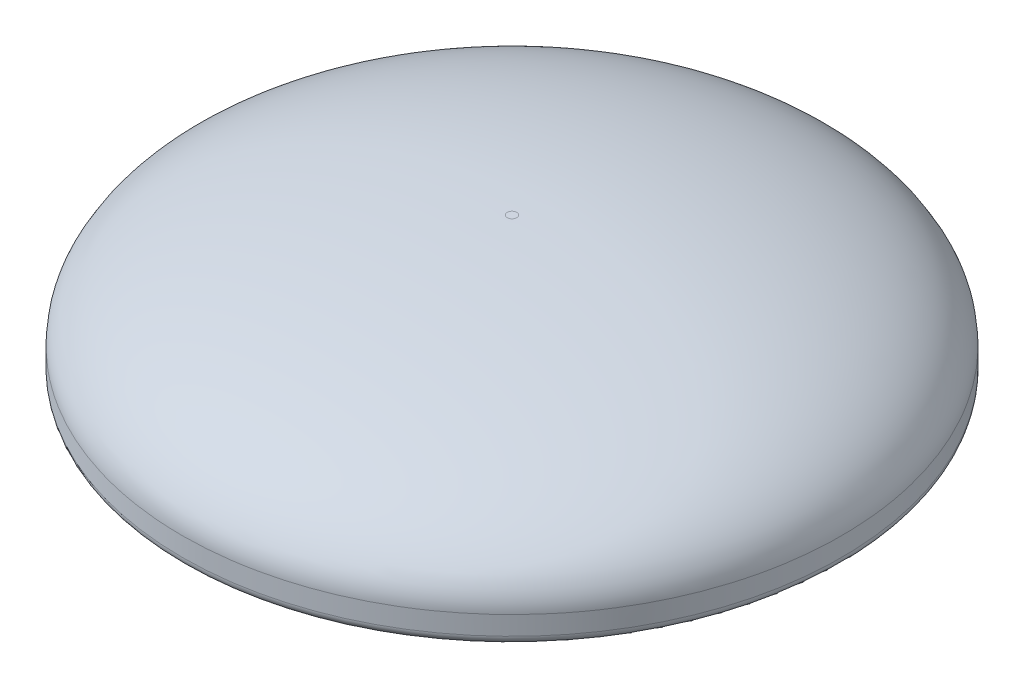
ISO-10303-21;
HEADER;
FILE_DESCRIPTION(('STEP AP214'),'2;1');
FILE_NAME('part.step','',(''),(''),'','','');
FILE_SCHEMA(('AUTOMOTIVE_DESIGN { 1 0 10303 214 1 1 1 1 }'));
ENDSEC;
DATA;
#1=APPLICATION_CONTEXT('core data for automotive mechanical design processes');
#2=APPLICATION_PROTOCOL_DEFINITION('international standard','automotive_design',2000,#1);
#3=PRODUCT_CONTEXT('',#1,'mechanical');
#4=PRODUCT('Part','Part','',(#3));
#5=PRODUCT_RELATED_PRODUCT_CATEGORY('part','',(#4));
#6=PRODUCT_DEFINITION_FORMATION('','',#4);
#7=PRODUCT_DEFINITION_CONTEXT('part definition',#1,'design');
#8=PRODUCT_DEFINITION('design','',#6,#7);
#9=PRODUCT_DEFINITION_SHAPE('','',#8);
#10=(LENGTH_UNIT() NAMED_UNIT(*) SI_UNIT(.MILLI.,.METRE.));
#11=(NAMED_UNIT(*) PLANE_ANGLE_UNIT() SI_UNIT($,.RADIAN.));
#12=(NAMED_UNIT(*) SI_UNIT($,.STERADIAN.) SOLID_ANGLE_UNIT());
#13=UNCERTAINTY_MEASURE_WITH_UNIT(LENGTH_MEASURE(1.E-05),#10,'distance_accuracy_value','');
#14=(GEOMETRIC_REPRESENTATION_CONTEXT(3) GLOBAL_UNCERTAINTY_ASSIGNED_CONTEXT((#13)) GLOBAL_UNIT_ASSIGNED_CONTEXT((#10,
#11,#12)) REPRESENTATION_CONTEXT('',''));
#15=CARTESIAN_POINT('',(0.,0.,0.));
#16=DIRECTION('',(0.,0.,1.));
#17=DIRECTION('',(1.,0.,0.));
#18=AXIS2_PLACEMENT_3D('',#15,#16,#17);
#19=CARTESIAN_POINT('',(0.,15.,0.));
#20=DIRECTION('',(0.,-1.,0.));
#21=DIRECTION('',(0.,0.,-1.));
#22=AXIS2_PLACEMENT_3D('',#19,#20,#21);
#23=CYLINDRICAL_SURFACE('',#22,35.);
#24=CARTESIAN_POINT('',(0.,3.,35.));
#25=CARTESIAN_POINT('',(4.5814862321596,3.,35.));
#26=CARTESIAN_POINT('',(9.16117877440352,3.,34.0890425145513));
#27=CARTESIAN_POINT('',(17.6266614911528,3.,30.5825247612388));
#28=CARTESIAN_POINT('',(21.5091373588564,3.,27.988337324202));
#29=CARTESIAN_POINT('',(27.988337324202,3.,21.5091373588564));
#30=CARTESIAN_POINT('',(30.5825247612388,3.,17.6266614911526));
#31=CARTESIAN_POINT('',(34.0890425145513,3.,9.16117877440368));
#32=CARTESIAN_POINT('',(35.,3.,4.58148623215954));
#33=CARTESIAN_POINT('',(35.,3.,-4.58148623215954));
#34=CARTESIAN_POINT('',(34.0890425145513,3.,-9.16117877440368));
#35=CARTESIAN_POINT('',(30.5825247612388,3.,-17.6266614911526));
#36=CARTESIAN_POINT('',(27.9883373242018,3.,-21.5091373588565));
#37=CARTESIAN_POINT('',(21.5091373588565,3.,-27.9883373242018));
#38=CARTESIAN_POINT('',(17.6266614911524,3.,-30.5825247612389));
#39=CARTESIAN_POINT('',(9.16117877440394,3.,-34.0890425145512));
#40=CARTESIAN_POINT('',(4.58148623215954,3.,-35.));
#41=CARTESIAN_POINT('',(-4.58148623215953,3.,-35.));
#42=CARTESIAN_POINT('',(-9.16117877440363,3.,-34.0890425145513));
#43=CARTESIAN_POINT('',(-17.6266614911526,3.,-30.5825247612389));
#44=CARTESIAN_POINT('',(-21.5091373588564,3.,-27.9883373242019));
#45=CARTESIAN_POINT('',(-27.988337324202,3.,-21.5091373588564));
#46=CARTESIAN_POINT('',(-30.5825247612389,3.,-17.6266614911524));
#47=CARTESIAN_POINT('',(-34.0890425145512,3.,-9.16117877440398));
#48=CARTESIAN_POINT('',(-35.,3.,-4.58148623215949));
#49=CARTESIAN_POINT('',(-35.,3.,4.5814862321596));
#50=CARTESIAN_POINT('',(-34.0890425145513,3.,9.16117877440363));
#51=CARTESIAN_POINT('',(-30.5825247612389,3.,17.6266614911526));
#52=CARTESIAN_POINT('',(-27.9883373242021,3.,21.5091373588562));
#53=CARTESIAN_POINT('',(-21.5091373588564,3.,27.988337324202));
#54=CARTESIAN_POINT('',(-17.6266614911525,3.,30.5825247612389));
#55=CARTESIAN_POINT('',(-9.16117877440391,3.,34.0890425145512));
#56=CARTESIAN_POINT('',(-4.5814862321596,3.,35.));
#57=CARTESIAN_POINT('',(0.,3.,35.));
#58=(BOUNDED_CURVE() B_SPLINE_CURVE(3,(#24,#25,#26,#27,#28,#29,#30,#31,#32,#33,#34,#35,#36,#37,
#38,#39,#40,#41,#42,#43,#44,#45,#46,#47,#48,#49,#50,#51,#52,#53,#54,#55,#56,#57),.UNSPECIFIED.,
.T.,.F.) B_SPLINE_CURVE_WITH_KNOTS((4,2,2,2,2,2,2,2,2,2,2,2,2,2,2,2,4),(0.,0.392699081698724,
0.785398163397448,1.17809724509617,1.5707963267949,1.96349540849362,2.35619449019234,
2.74889357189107,3.14159265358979,3.53429173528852,3.92699081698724,4.31968989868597,
4.71238898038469,5.10508806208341,5.49778714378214,5.89048622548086,6.28318530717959),
.UNSPECIFIED.) CURVE() GEOMETRIC_REPRESENTATION_ITEM() RATIONAL_B_SPLINE_CURVE((1.,1.,1.,1.,1.,
1.,1.,1.,1.,1.,1.,1.,1.,1.,1.,1.,1.,1.,1.,1.,1.,1.,1.,1.,1.,1.,1.,1.,1.,1.,1.,1.,1.,1.)) REPRESENTATION_ITEM(''));
#59=CARTESIAN_POINT('',(0.,3.,35.));
#60=VERTEX_POINT('',#59);
#61=EDGE_CURVE('E11',#60,#60,#58,.F.);
#62=ORIENTED_EDGE('',*,*,#61,.T.);
#63=EDGE_LOOP('',(#62));
#64=FACE_BOUND('',#63,.T.);
#65=CARTESIAN_POINT('',(0.,1.,0.));
#66=DIRECTION('',(0.,1.,0.));
#67=DIRECTION('',(0.,0.,1.));
#68=AXIS2_PLACEMENT_3D('',#65,#66,#67);
#69=CIRCLE('',#68,35.);
#70=CARTESIAN_POINT('',(0.,1.,35.));
#71=VERTEX_POINT('',#70);
#72=EDGE_CURVE('E62',#71,#71,#69,.T.);
#73=ORIENTED_EDGE('',*,*,#72,.T.);
#74=EDGE_LOOP('',(#73));
#75=FACE_BOUND('',#74,.T.);
#76=ADVANCED_FACE('F39',(#64,#75),#23,.T.);
#77=CARTESIAN_POINT('',(0.,15.,0.));
#78=DIRECTION('',(0.,1.,0.));
#79=DIRECTION('',(0.,0.,1.));
#80=AXIS2_PLACEMENT_3D('',#77,#78,#79);
#81=PLANE('',#80);
#82=CARTESIAN_POINT('',(0.,15.,0.500000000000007));
#83=CARTESIAN_POINT('',(-0.0654498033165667,15.,0.500000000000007));
#84=CARTESIAN_POINT('',(-0.130873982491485,15.,0.486986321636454));
#85=CARTESIAN_POINT('',(-0.251809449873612,15.,0.436893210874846));
#86=CARTESIAN_POINT('',(-0.30727339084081,15.,0.399833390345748));
#87=CARTESIAN_POINT('',(-0.39983339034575,15.,0.307273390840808));
#88=CARTESIAN_POINT('',(-0.436893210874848,15.,0.251809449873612));
#89=CARTESIAN_POINT('',(-0.486986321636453,15.,0.130873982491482));
#90=CARTESIAN_POINT('',(-0.500000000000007,15.,0.0654498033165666));
#91=CARTESIAN_POINT('',(-0.500000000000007,15.,-0.065449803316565));
#92=CARTESIAN_POINT('',(-0.486986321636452,15.,-0.130873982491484));
#93=CARTESIAN_POINT('',(-0.436893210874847,15.,-0.251809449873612));
#94=CARTESIAN_POINT('',(-0.399833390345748,15.,-0.30727339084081));
#95=CARTESIAN_POINT('',(-0.307273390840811,15.,-0.399833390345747));
#96=CARTESIAN_POINT('',(-0.251809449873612,15.,-0.436893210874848));
#97=CARTESIAN_POINT('',(-0.130873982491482,15.,-0.486986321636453));
#98=CARTESIAN_POINT('',(-0.0654498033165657,15.,-0.500000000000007));
#99=CARTESIAN_POINT('',(0.0654498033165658,15.,-0.500000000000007));
#100=CARTESIAN_POINT('',(0.130873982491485,15.,-0.486986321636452));
#101=CARTESIAN_POINT('',(0.251809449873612,15.,-0.436893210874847));
#102=CARTESIAN_POINT('',(0.30727339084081,15.,-0.399833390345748));
#103=CARTESIAN_POINT('',(0.399833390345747,15.,-0.307273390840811));
#104=CARTESIAN_POINT('',(0.436893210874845,15.,-0.251809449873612));
#105=CARTESIAN_POINT('',(0.486986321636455,15.,-0.130873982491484));
#106=CARTESIAN_POINT('',(0.500000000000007,15.,-0.0654498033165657));
#107=CARTESIAN_POINT('',(0.500000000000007,15.,0.0654498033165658));
#108=CARTESIAN_POINT('',(0.486986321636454,15.,0.130873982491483));
#109=CARTESIAN_POINT('',(0.436893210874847,15.,0.251809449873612));
#110=CARTESIAN_POINT('',(0.399833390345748,15.,0.30727339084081));
#111=CARTESIAN_POINT('',(0.30727339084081,15.,0.399833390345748));
#112=CARTESIAN_POINT('',(0.251809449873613,15.,0.436893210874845));
#113=CARTESIAN_POINT('',(0.130873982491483,15.,0.486986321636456));
#114=CARTESIAN_POINT('',(0.0654498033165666,15.,0.500000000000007));
#115=CARTESIAN_POINT('',(0.,15.,0.500000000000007));
#116=(BOUNDED_CURVE() B_SPLINE_CURVE(3,(#82,#83,#84,#85,#86,#87,#88,#89,#90,#91,#92,#93,#94,#95,
#96,#97,#98,#99,#100,#101,#102,#103,#104,#105,#106,#107,#108,#109,#110,#111,#112,#113,#114,
#115),.UNSPECIFIED.,.T.,.F.) B_SPLINE_CURVE_WITH_KNOTS((4,2,2,2,2,2,2,2,2,2,2,2,2,2,2,2,4),(0.,
0.392699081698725,0.785398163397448,1.17809724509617,1.5707963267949,1.96349540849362,
2.35619449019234,2.74889357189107,3.14159265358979,3.53429173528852,3.92699081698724,
4.31968989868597,4.71238898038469,5.10508806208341,5.49778714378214,5.89048622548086,
6.28318530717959),
.UNSPECIFIED.) CURVE() GEOMETRIC_REPRESENTATION_ITEM() RATIONAL_B_SPLINE_CURVE((1.,1.,1.,1.,1.,
1.,1.,1.,1.,1.,1.,1.,1.,1.,1.,1.,1.,1.,1.,1.,1.,1.,1.,1.,1.,1.,1.,1.,1.,1.,1.,1.,1.,1.)) REPRESENTATION_ITEM(''));
#117=CARTESIAN_POINT('',(0.,15.,0.500000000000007));
#118=VERTEX_POINT('',#117);
#119=EDGE_CURVE('E52',#118,#118,#116,.F.);
#120=ORIENTED_EDGE('',*,*,#119,.T.);
#121=EDGE_LOOP('',(#120));
#122=FACE_BOUND('',#121,.T.);
#123=ADVANCED_FACE('F73',(#122),#81,.T.);
#124=CARTESIAN_POINT('',(0.,0.,0.));
#125=DIRECTION('',(0.,1.,0.));
#126=DIRECTION('',(0.,0.,1.));
#127=AXIS2_PLACEMENT_3D('',#124,#125,#126);
#128=PLANE('',#127);
#129=CARTESIAN_POINT('',(0.,0.,0.));
#130=DIRECTION('',(0.,1.,0.));
#131=DIRECTION('',(0.,0.,1.));
#132=AXIS2_PLACEMENT_3D('',#129,#130,#131);
#133=CIRCLE('',#132,34.);
#134=CARTESIAN_POINT('',(0.,0.,34.));
#135=VERTEX_POINT('',#134);
#136=EDGE_CURVE('E57',#135,#135,#133,.F.);
#137=ORIENTED_EDGE('',*,*,#136,.T.);
#138=EDGE_LOOP('',(#137));
#139=FACE_BOUND('',#138,.T.);
#140=ADVANCED_FACE('F82',(#139),#128,.F.);
#141=CARTESIAN_POINT('',(0.,1.,0.));
#142=DIRECTION('',(0.,1.,0.));
#143=DIRECTION('',(0.,0.,1.));
#144=AXIS2_PLACEMENT_3D('',#141,#142,#143);
#145=TOROIDAL_SURFACE('',#144,34.,1.);
#146=ORIENTED_EDGE('',*,*,#136,.F.);
#147=EDGE_LOOP('',(#146));
#148=FACE_BOUND('',#147,.T.);
#149=ORIENTED_EDGE('',*,*,#72,.F.);
#150=EDGE_LOOP('',(#149));
#151=FACE_BOUND('',#150,.T.);
#152=ADVANCED_FACE('F85',(#148,#151),#145,.T.);
#153=CARTESIAN_POINT('',(0.,15.,0.500000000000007));
#154=CARTESIAN_POINT('',(0.0654498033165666,15.,0.500000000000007));
#155=CARTESIAN_POINT('',(0.130873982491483,15.,0.486986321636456));
#156=CARTESIAN_POINT('',(0.251809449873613,15.,0.436893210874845));
#157=CARTESIAN_POINT('',(0.30727339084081,15.,0.399833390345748));
#158=CARTESIAN_POINT('',(0.399833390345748,15.,0.30727339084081));
#159=CARTESIAN_POINT('',(0.436893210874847,15.,0.251809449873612));
#160=CARTESIAN_POINT('',(0.486986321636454,15.,0.130873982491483));
#161=CARTESIAN_POINT('',(0.500000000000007,15.,0.0654498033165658));
#162=CARTESIAN_POINT('',(0.500000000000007,15.,-0.0654498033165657));
#163=CARTESIAN_POINT('',(0.486986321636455,15.,-0.130873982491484));
#164=CARTESIAN_POINT('',(0.436893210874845,15.,-0.251809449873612));
#165=CARTESIAN_POINT('',(0.399833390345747,15.,-0.307273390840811));
#166=CARTESIAN_POINT('',(0.30727339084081,15.,-0.399833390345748));
#167=CARTESIAN_POINT('',(0.251809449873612,15.,-0.436893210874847));
#168=CARTESIAN_POINT('',(0.130873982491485,15.,-0.486986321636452));
#169=CARTESIAN_POINT('',(0.0654498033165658,15.,-0.500000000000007));
#170=CARTESIAN_POINT('',(-0.0654498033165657,15.,-0.500000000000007));
#171=CARTESIAN_POINT('',(-0.130873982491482,15.,-0.486986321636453));
#172=CARTESIAN_POINT('',(-0.251809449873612,15.,-0.436893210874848));
#173=CARTESIAN_POINT('',(-0.307273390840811,15.,-0.399833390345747));
#174=CARTESIAN_POINT('',(-0.399833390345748,15.,-0.30727339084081));
#175=CARTESIAN_POINT('',(-0.436893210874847,15.,-0.251809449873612));
#176=CARTESIAN_POINT('',(-0.486986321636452,15.,-0.130873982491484));
#177=CARTESIAN_POINT('',(-0.500000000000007,15.,-0.065449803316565));
#178=CARTESIAN_POINT('',(-0.500000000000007,15.,0.0654498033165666));
#179=CARTESIAN_POINT('',(-0.486986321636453,15.,0.130873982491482));
#180=CARTESIAN_POINT('',(-0.436893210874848,15.,0.251809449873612));
#181=CARTESIAN_POINT('',(-0.39983339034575,15.,0.307273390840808));
#182=CARTESIAN_POINT('',(-0.30727339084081,15.,0.399833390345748));
#183=CARTESIAN_POINT('',(-0.251809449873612,15.,0.436893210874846));
#184=CARTESIAN_POINT('',(-0.130873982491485,15.,0.486986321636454));
#185=CARTESIAN_POINT('',(-0.0654498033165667,15.,0.500000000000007));
#186=CARTESIAN_POINT('',(0.,15.,0.500000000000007));
#187=CARTESIAN_POINT('',(0.,15.,35.));
#188=CARTESIAN_POINT('',(4.5814862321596,14.9999999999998,35.));
#189=CARTESIAN_POINT('',(9.16117877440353,14.9999999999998,34.0890425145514));
#190=CARTESIAN_POINT('',(17.6266614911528,15.0000000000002,30.5825247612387));
#191=CARTESIAN_POINT('',(21.5091373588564,14.9999999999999,27.988337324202));
#192=CARTESIAN_POINT('',(27.988337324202,15.0000000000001,21.5091373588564));
#193=CARTESIAN_POINT('',(30.5825247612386,15.,17.6266614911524));
#194=CARTESIAN_POINT('',(34.0890425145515,15.,9.16117877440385));
#195=CARTESIAN_POINT('',(35.,15.,4.58148623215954));
#196=CARTESIAN_POINT('',(35.,15.,-4.58148623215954));
#197=CARTESIAN_POINT('',(34.0890425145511,15.,-9.1611787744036));
#198=CARTESIAN_POINT('',(30.582524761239,15.,-17.6266614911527));
#199=CARTESIAN_POINT('',(27.9883373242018,15.,-21.5091373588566));
#200=CARTESIAN_POINT('',(21.5091373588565,15.,-27.9883373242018));
#201=CARTESIAN_POINT('',(17.6266614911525,15.,-30.582524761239));
#202=CARTESIAN_POINT('',(9.16117877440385,15.,-34.089042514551));
#203=CARTESIAN_POINT('',(4.58148623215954,15.,-35.));
#204=CARTESIAN_POINT('',(-4.58148623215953,15.,-35.));
#205=CARTESIAN_POINT('',(-9.1611787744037,15.,-34.0890425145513));
#206=CARTESIAN_POINT('',(-17.6266614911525,15.,-30.5825247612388));
#207=CARTESIAN_POINT('',(-21.5091373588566,15.,-27.9883373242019));
#208=CARTESIAN_POINT('',(-27.9883373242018,15.,-21.5091373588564));
#209=CARTESIAN_POINT('',(-30.5825247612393,15.,-17.6266614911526));
#210=CARTESIAN_POINT('',(-34.0890425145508,15.,-9.16117877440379));
#211=CARTESIAN_POINT('',(-35.,15.,-4.58148623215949));
#212=CARTESIAN_POINT('',(-35.,15.,4.5814862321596));
#213=CARTESIAN_POINT('',(-34.0890425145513,15.,9.16117877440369));
#214=CARTESIAN_POINT('',(-30.5825247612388,15.,17.6266614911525));
#215=CARTESIAN_POINT('',(-27.9883373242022,15.,21.5091373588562));
#216=CARTESIAN_POINT('',(-21.5091373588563,15.,27.988337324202));
#217=CARTESIAN_POINT('',(-17.6266614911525,15.,30.5825247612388));
#218=CARTESIAN_POINT('',(-9.1611787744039,15.,34.0890425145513));
#219=CARTESIAN_POINT('',(-4.58148623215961,15.0000000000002,35.));
#220=CARTESIAN_POINT('',(0.,15.,35.));
#221=CARTESIAN_POINT('',(0.,3.,35.));
#222=CARTESIAN_POINT('',(4.5814862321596,3.,35.));
#223=CARTESIAN_POINT('',(9.16117877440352,3.,34.0890425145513));
#224=CARTESIAN_POINT('',(17.6266614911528,3.,30.5825247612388));
#225=CARTESIAN_POINT('',(21.5091373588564,3.,27.988337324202));
#226=CARTESIAN_POINT('',(27.988337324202,3.,21.5091373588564));
#227=CARTESIAN_POINT('',(30.5825247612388,3.,17.6266614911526));
#228=CARTESIAN_POINT('',(34.0890425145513,3.,9.16117877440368));
#229=CARTESIAN_POINT('',(35.,3.,4.58148623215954));
#230=CARTESIAN_POINT('',(35.,3.,-4.58148623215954));
#231=CARTESIAN_POINT('',(34.0890425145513,3.,-9.16117877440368));
#232=CARTESIAN_POINT('',(30.5825247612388,3.,-17.6266614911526));
#233=CARTESIAN_POINT('',(27.9883373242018,3.,-21.5091373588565));
#234=CARTESIAN_POINT('',(21.5091373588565,3.,-27.9883373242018));
#235=CARTESIAN_POINT('',(17.6266614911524,3.,-30.5825247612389));
#236=CARTESIAN_POINT('',(9.16117877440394,3.,-34.0890425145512));
#237=CARTESIAN_POINT('',(4.58148623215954,3.,-35.));
#238=CARTESIAN_POINT('',(-4.58148623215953,3.,-35.));
#239=CARTESIAN_POINT('',(-9.16117877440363,3.,-34.0890425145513));
#240=CARTESIAN_POINT('',(-17.6266614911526,3.,-30.5825247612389));
#241=CARTESIAN_POINT('',(-21.5091373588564,3.,-27.9883373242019));
#242=CARTESIAN_POINT('',(-27.988337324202,3.,-21.5091373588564));
#243=CARTESIAN_POINT('',(-30.5825247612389,3.,-17.6266614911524));
#244=CARTESIAN_POINT('',(-34.0890425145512,3.,-9.16117877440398));
#245=CARTESIAN_POINT('',(-35.,3.,-4.58148623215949));
#246=CARTESIAN_POINT('',(-35.,3.,4.5814862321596));
#247=CARTESIAN_POINT('',(-34.0890425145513,3.,9.16117877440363));
#248=CARTESIAN_POINT('',(-30.5825247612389,3.,17.6266614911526));
#249=CARTESIAN_POINT('',(-27.9883373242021,3.,21.5091373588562));
#250=CARTESIAN_POINT('',(-21.5091373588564,3.,27.988337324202));
#251=CARTESIAN_POINT('',(-17.6266614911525,3.,30.5825247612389));
#252=CARTESIAN_POINT('',(-9.16117877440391,3.,34.0890425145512));
#253=CARTESIAN_POINT('',(-4.5814862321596,3.,35.));
#254=CARTESIAN_POINT('',(0.,3.,35.));
#255=(BOUNDED_SURFACE() B_SPLINE_SURFACE(2,3,((#153,#154,#155,#156,#157,#158,#159,#160,#161,
#162,#163,#164,#165,#166,#167,#168,#169,#170,#171,#172,#173,#174,#175,#176,#177,#178,#179,#180,
#181,#182,#183,#184,#185,#186),(#187,#188,#189,#190,#191,#192,#193,#194,#195,#196,#197,#198,
#199,#200,#201,#202,#203,#204,#205,#206,#207,#208,#209,#210,#211,#212,#213,#214,#215,#216,#217,
#218,#219,#220),(#221,#222,#223,#224,#225,#226,#227,#228,#229,#230,#231,#232,#233,#234,#235,
#236,#237,#238,#239,#240,#241,#242,#243,#244,#245,#246,#247,#248,#249,#250,#251,#252,#253,
#254)),.UNSPECIFIED.,.F.,.T.,.F.) B_SPLINE_SURFACE_WITH_KNOTS((3,3),(4,2,2,2,2,2,2,2,2,2,2,2,2,
2,2,2,4),(0.,1.),(0.,0.392699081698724,0.785398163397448,1.17809724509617,1.5707963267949,
1.96349540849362,2.35619449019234,2.74889357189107,3.14159265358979,3.53429173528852,
3.92699081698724,4.31968989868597,4.71238898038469,5.10508806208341,5.49778714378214,
5.89048622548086,6.28318530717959),
.UNSPECIFIED.) GEOMETRIC_REPRESENTATION_ITEM() RATIONAL_B_SPLINE_SURFACE(((1.,1.,1.,1.,1.,1.,1.,
1.,1.,1.,1.,1.,1.,1.,1.,1.,1.,1.,1.,1.,1.,1.,1.,1.,1.,1.,1.,1.,1.,1.,1.,1.,1.,1.),
(0.707106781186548,0.707106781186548,0.707106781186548,0.707106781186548,0.707106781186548,
0.707106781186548,0.707106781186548,0.707106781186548,0.707106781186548,0.707106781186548,
0.707106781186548,0.707106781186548,0.707106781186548,0.707106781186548,0.707106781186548,
0.707106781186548,0.707106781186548,0.707106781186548,0.707106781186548,0.707106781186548,
0.707106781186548,0.707106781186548,0.707106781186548,0.707106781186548,0.707106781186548,
0.707106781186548,0.707106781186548,0.707106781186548,0.707106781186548,0.707106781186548,
0.707106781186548,0.707106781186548,0.707106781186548,0.707106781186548),(1.,1.,1.,1.,1.,1.,1.,
1.,1.,1.,1.,1.,1.,1.,1.,1.,1.,1.,1.,1.,1.,1.,1.,1.,1.,1.,1.,1.,1.,1.,1.,1.,1.,1.))) REPRESENTATION_ITEM('') SURFACE());
#256=ORIENTED_EDGE('',*,*,#61,.F.);
#257=EDGE_LOOP('',(#256));
#258=FACE_BOUND('',#257,.T.);
#259=ORIENTED_EDGE('',*,*,#119,.F.);
#260=EDGE_LOOP('',(#259));
#261=FACE_BOUND('',#260,.T.);
#262=ADVANCED_FACE('F42',(#258,#261),#255,.T.);
#263=CLOSED_SHELL('',(#76,#123,#140,#152,#262));
#264=MANIFOLD_SOLID_BREP('B2',#263);
#265=ADVANCED_BREP_SHAPE_REPRESENTATION('',(#18,#264),#14);
#266=SHAPE_DEFINITION_REPRESENTATION(#9,#265);
ENDSEC;
END-ISO-10303-21;
